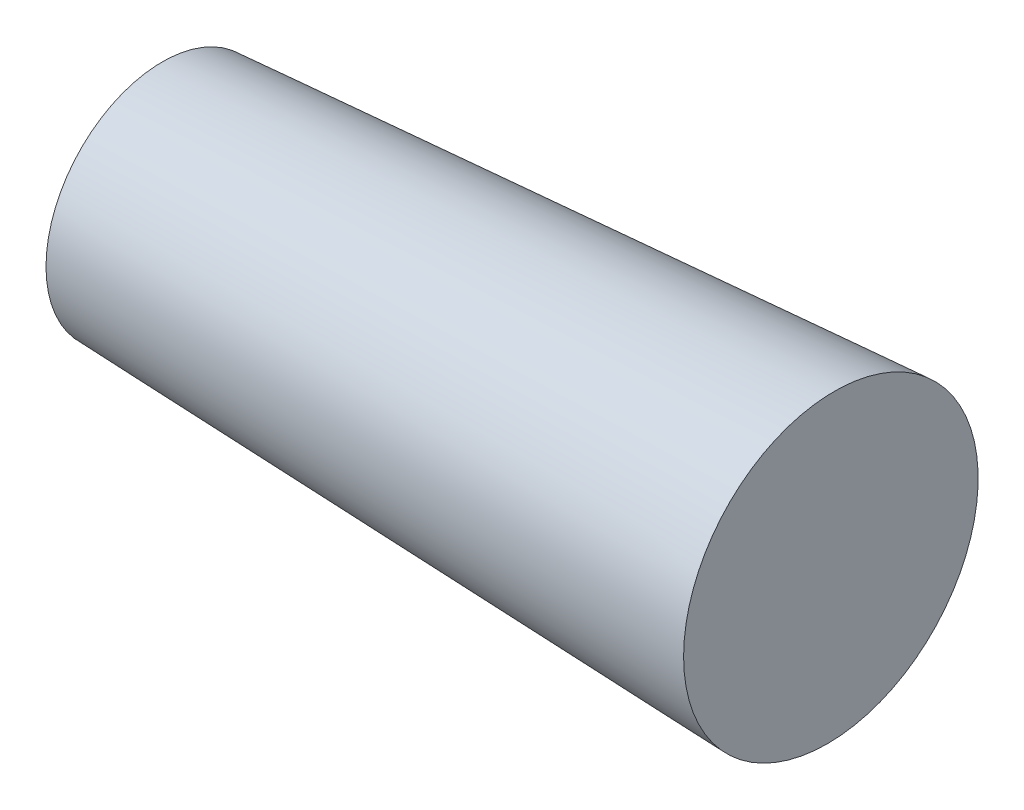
ISO-10303-21;
HEADER;
FILE_DESCRIPTION(('STEP AP214'),'2;1');
FILE_NAME('part.step','',(''),(''),'','','');
FILE_SCHEMA(('AUTOMOTIVE_DESIGN { 1 0 10303 214 1 1 1 1 }'));
ENDSEC;
DATA;
#1=APPLICATION_CONTEXT('core data for automotive mechanical design processes');
#2=APPLICATION_PROTOCOL_DEFINITION('international standard','automotive_design',2000,#1);
#3=PRODUCT_CONTEXT('',#1,'mechanical');
#4=PRODUCT('Part','Part','',(#3));
#5=PRODUCT_RELATED_PRODUCT_CATEGORY('part','',(#4));
#6=PRODUCT_DEFINITION_FORMATION('','',#4);
#7=PRODUCT_DEFINITION_CONTEXT('part definition',#1,'design');
#8=PRODUCT_DEFINITION('design','',#6,#7);
#9=PRODUCT_DEFINITION_SHAPE('','',#8);
#10=(LENGTH_UNIT() NAMED_UNIT(*) SI_UNIT(.MILLI.,.METRE.));
#11=(NAMED_UNIT(*) PLANE_ANGLE_UNIT() SI_UNIT($,.RADIAN.));
#12=(NAMED_UNIT(*) SI_UNIT($,.STERADIAN.) SOLID_ANGLE_UNIT());
#13=UNCERTAINTY_MEASURE_WITH_UNIT(LENGTH_MEASURE(1.E-05),#10,'distance_accuracy_value','');
#14=(GEOMETRIC_REPRESENTATION_CONTEXT(3) GLOBAL_UNCERTAINTY_ASSIGNED_CONTEXT((#13)) GLOBAL_UNIT_ASSIGNED_CONTEXT((#10,
#11,#12)) REPRESENTATION_CONTEXT('',''));
#15=CARTESIAN_POINT('',(0.,0.,0.));
#16=DIRECTION('',(0.,0.,1.));
#17=DIRECTION('',(1.,0.,0.));
#18=AXIS2_PLACEMENT_3D('',#15,#16,#17);
#19=CARTESIAN_POINT('',(9.85298186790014,0.,-0.231834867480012));
#20=DIRECTION('',(0.999723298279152,0.,-0.0235229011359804));
#21=DIRECTION('',(-0.0235229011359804,0.,-0.999723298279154));
#22=AXIS2_PLACEMENT_3D('',#19,#20,#21);
#23=CONICAL_SURFACE('',#22,6.24999999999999,0.0523598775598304);
#24=CARTESIAN_POINT('',(-17.3121065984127,0.,0.407343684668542));
#25=DIRECTION('',(-0.999723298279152,0.,0.0235229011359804));
#26=DIRECTION('',(0.0235229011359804,0.,0.999723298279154));
#27=AXIS2_PLACEMENT_3D('',#24,#25,#26);
#28=CIRCLE('',#27,4.82594400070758);
#29=CARTESIAN_POINT('',(-17.1985863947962,0.,5.23195233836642));
#30=VERTEX_POINT('',#29);
#31=EDGE_CURVE('E10',#30,#30,#28,.T.);
#32=ORIENTED_EDGE('',*,*,#31,.F.);
#33=EDGE_LOOP('',(#32));
#34=FACE_BOUND('',#33,.T.);
#35=CARTESIAN_POINT('',(9.85298186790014,0.,-0.231834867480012));
#36=DIRECTION('',(-0.999723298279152,0.,0.0235229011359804));
#37=DIRECTION('',(0.0235229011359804,0.,0.999723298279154));
#38=AXIS2_PLACEMENT_3D('',#35,#36,#37);
#39=CIRCLE('',#38,6.24999999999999);
#40=CARTESIAN_POINT('',(10.,0.,6.0164357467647));
#41=VERTEX_POINT('',#40);
#42=EDGE_CURVE('E37',#41,#41,#39,.T.);
#43=ORIENTED_EDGE('',*,*,#42,.T.);
#44=EDGE_LOOP('',(#43));
#45=FACE_BOUND('',#44,.T.);
#46=ADVANCED_FACE('F31',(#34,#45),#23,.T.);
#47=CARTESIAN_POINT('',(-17.3121065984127,0.,0.407343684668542));
#48=DIRECTION('',(0.999723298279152,0.,-0.0235229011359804));
#49=DIRECTION('',(-0.0235229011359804,0.,-0.999723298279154));
#50=AXIS2_PLACEMENT_3D('',#47,#48,#49);
#51=PLANE('',#50);
#52=ORIENTED_EDGE('',*,*,#31,.T.);
#53=EDGE_LOOP('',(#52));
#54=FACE_BOUND('',#53,.T.);
#55=ADVANCED_FACE('F46',(#54),#51,.F.);
#56=CARTESIAN_POINT('',(9.85298186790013,0.,-0.231834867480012));
#57=DIRECTION('',(-0.999723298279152,0.,0.0235229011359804));
#58=DIRECTION('',(0.0235229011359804,0.,0.999723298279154));
#59=AXIS2_PLACEMENT_3D('',#56,#57,#58);
#60=PLANE('',#59);
#61=ORIENTED_EDGE('',*,*,#42,.F.);
#62=EDGE_LOOP('',(#61));
#63=FACE_BOUND('',#62,.T.);
#64=ADVANCED_FACE('F44',(#63),#60,.F.);
#65=CLOSED_SHELL('',(#46,#55,#64));
#66=MANIFOLD_SOLID_BREP('B2',#65);
#67=ADVANCED_BREP_SHAPE_REPRESENTATION('',(#18,#66),#14);
#68=SHAPE_DEFINITION_REPRESENTATION(#9,#67);
ENDSEC;
END-ISO-10303-21;
